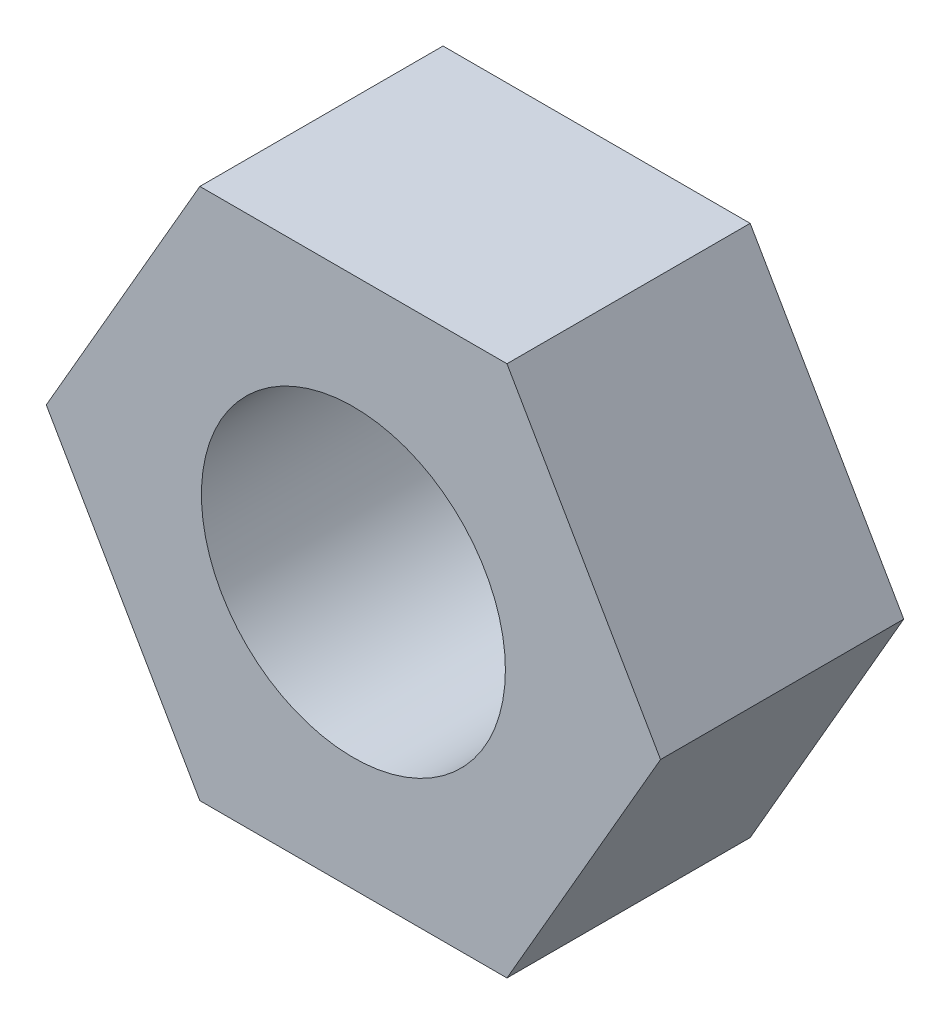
from build123d import *

# Parameters (mm, degrees)
SKETCH_1_R      = 2
EXTRUDE_1_DEPTH = 1.6


with BuildPart() as part:
    # Sketch 1 → Extrude 1 (new, symmetric)
    with BuildSketch(Plane.XY):
        Polygon((4.041451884, 0), (2.020725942, 3.5), (-2.020725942, 3.5), (-4.041451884, 0), (-2.020725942, -3.5), (2.020725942, -3.5), align=None)
        Circle(SKETCH_1_R, mode=Mode.SUBTRACT)
    extrude(amount=EXTRUDE_1_DEPTH, both=True)


solid = part.part
